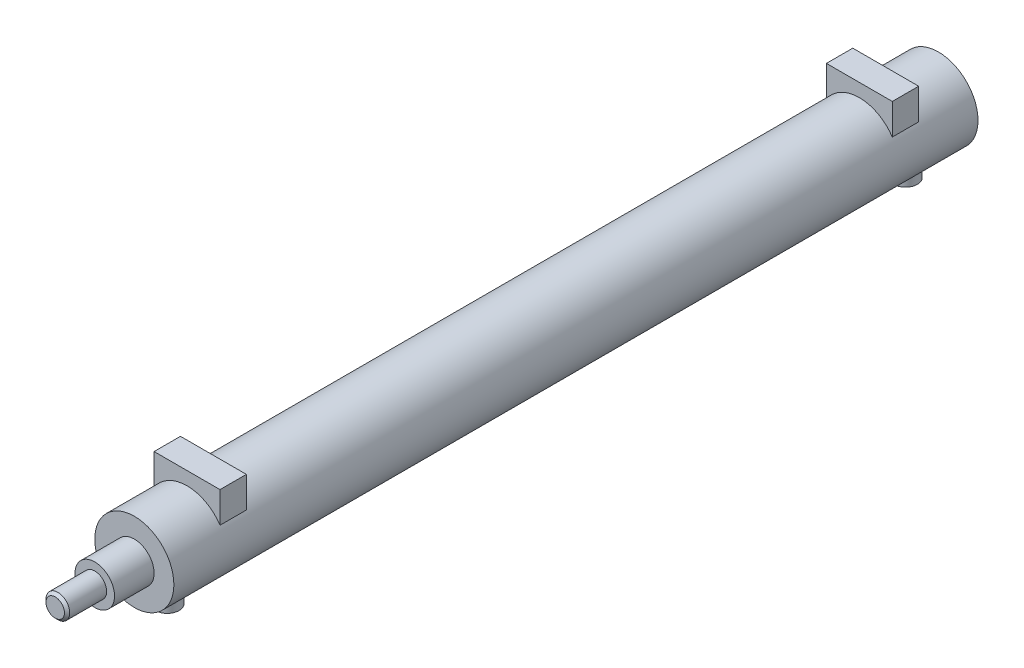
from build123d import *

# Parameters (mm, degrees)
SZKIC1_R                    = 30
DODANIE_WYCI_GNI_CIE1_DEPTH = 305
SZKIC3_R                    = 15
DODANIE_WYCI_GNI_CIE2_DEPTH = 30
SZKIC9_W                    = 50
SZKIC9_H                    = 20
DODANIE_WYCI_GNI_CIE6_DEPTH = 40
SZKIC10_R                   = 9
DODANIE_WYCI_GNI_CIE7_DEPTH = 30
SFAZOWANIE1_SIZE            = 2
SZKIC11_R                   = 9
SZKIC11_R_2                 = 6.35
DODANIE_WYCI_GNI_CIE8_DEPTH = 40


with BuildPart() as part:
    # Szkic1 → Dodanie-wyci_gni_cie1 (new, symmetric)
    with BuildSketch(Plane.XY):
        Circle(SZKIC1_R)
    extrude(amount=DODANIE_WYCI_GNI_CIE1_DEPTH, both=True)

    # Szkic3 → Dodanie-wyci_gni_cie2 (add)
    with BuildSketch(Plane.XY.offset(305)):
        Circle(SZKIC3_R)
    extrude(amount=DODANIE_WYCI_GNI_CIE2_DEPTH)

    # Szkic9 → Dodanie-wyci_gni_cie6 (add)
    with BuildSketch(Plane(origin=(0, 0, 0), x_dir=(1, 0, 0), z_dir=(0, 1, 0))):
        with Locations((0, 255)):
            Rectangle(SZKIC9_W, SZKIC9_H)
    dodanie_wyci_gni_cie6 = extrude(amount=DODANIE_WYCI_GNI_CIE6_DEPTH)

    # Lustro1: Dodanie-wyci_gni_cie6 across plane
    add(dodanie_wyci_gni_cie6.mirror(Plane.XY))

    # Szkic10 → Dodanie-wyci_gni_cie7 (add)
    with BuildSketch(Plane.XY.offset(335)):
        Circle(SZKIC10_R)
    extrude(amount=DODANIE_WYCI_GNI_CIE7_DEPTH)

    # Sfazowanie1
    sfazowanie1_edges = [part.edges().sort_by_distance(p)[0] for p in [
        (-9, 0, 365),
    ]]
    chamfer(sfazowanie1_edges, length=SFAZOWANIE1_SIZE)

    # Szkic11 → Dodanie-wyci_gni_cie8 (add)
    with BuildSketch(Plane(origin=(0, 0, 0), x_dir=(1, 0, 0), z_dir=(0, 1, 0))):
        with Locations(Location((0, -280, 0), (0, 0, 270))):
            Circle(SZKIC11_R)
        with Locations(Location((0, -280, 0), (0, 0, 270))):
            Circle(SZKIC11_R_2, mode=Mode.SUBTRACT)
    dodanie_wyci_gni_cie8 = extrude(amount=-DODANIE_WYCI_GNI_CIE8_DEPTH)

    # Lustro2: Dodanie-wyci_gni_cie8 across plane
    add(dodanie_wyci_gni_cie8.mirror(Plane.XY))


solid = part.part
